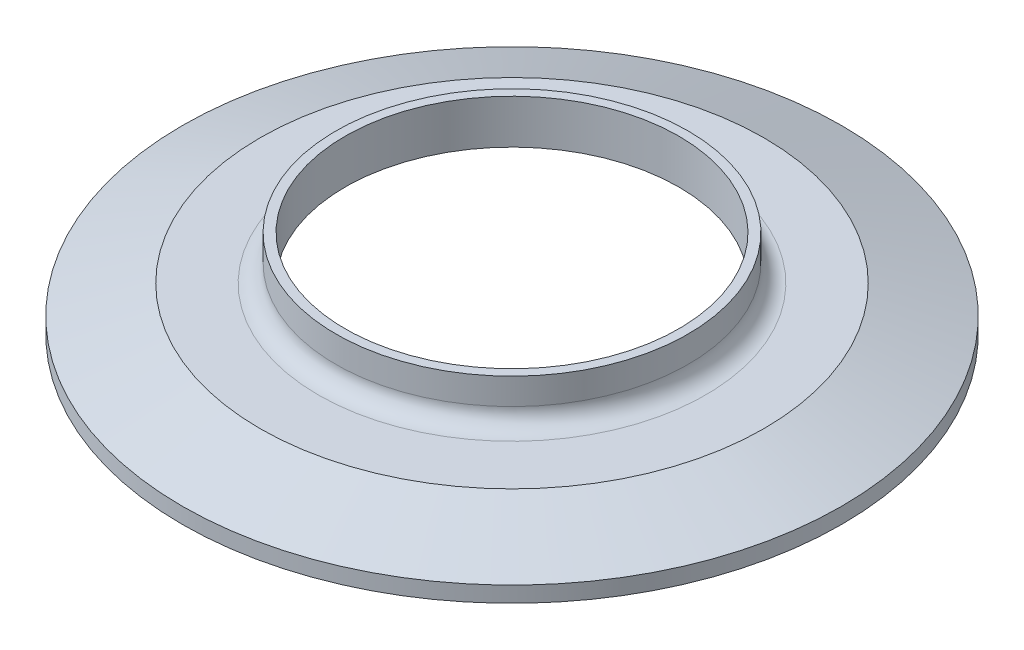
from build123d import *


with BuildPart() as part:
    # Sketch1 → Revolve1 (revolve)
    with BuildSketch(Plane.XY, mode=Mode.PRIVATE) as revolve1_sk:
        with BuildLine():
            Line((-31.75, 15.875), (-31.75, 11.1252))
            ThreePointArc((-31.75, 11.1252), (-32.67993597, 8.88013597), (-34.925, 7.9502))
            Line((-34.925, 7.9502), (-45.434428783, 7.9502))
            Line((-45.434428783, 7.9502), (-59.4614, 2.8448))
            Line((-59.4614, 2.8448), (-59.4614, 0))
            Line((-59.4614, 0), (-56.92485771, 0))
            ThreePointArc((-56.92485771, 0), (-56.416561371, 0.086556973), (-56.070800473, 0.469057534))
            Line((-56.070800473, 0.469057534), (-55.899398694, 0.872854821))
            ThreePointArc((-55.899398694, 0.872854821), (-54.8005, 1.6002), (-53.701601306, 0.872854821))
            Line((-53.701601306, 0.872854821), (-53.534733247, 0.479738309))
            ThreePointArc((-53.534733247, 0.479738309), (-53.244522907, 0.130798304), (-52.809927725, 0))
            Line((-52.809927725, 0), (-48.6918, 0))
            Line((-48.6918, 0), (-30.099, 7.922831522))
            Line((-30.099, 7.922831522), (-30.099, 15.875))
            Line((-30.099, 15.875), (-31.75, 15.875))
        make_face()
    revolve(revolve1_sk.sketch.rotate(Axis((0, 0, 0), (0, 1, 0)), 270), axis=Axis((0, 0, 0), (0, 1, 0)))


solid = part.part
